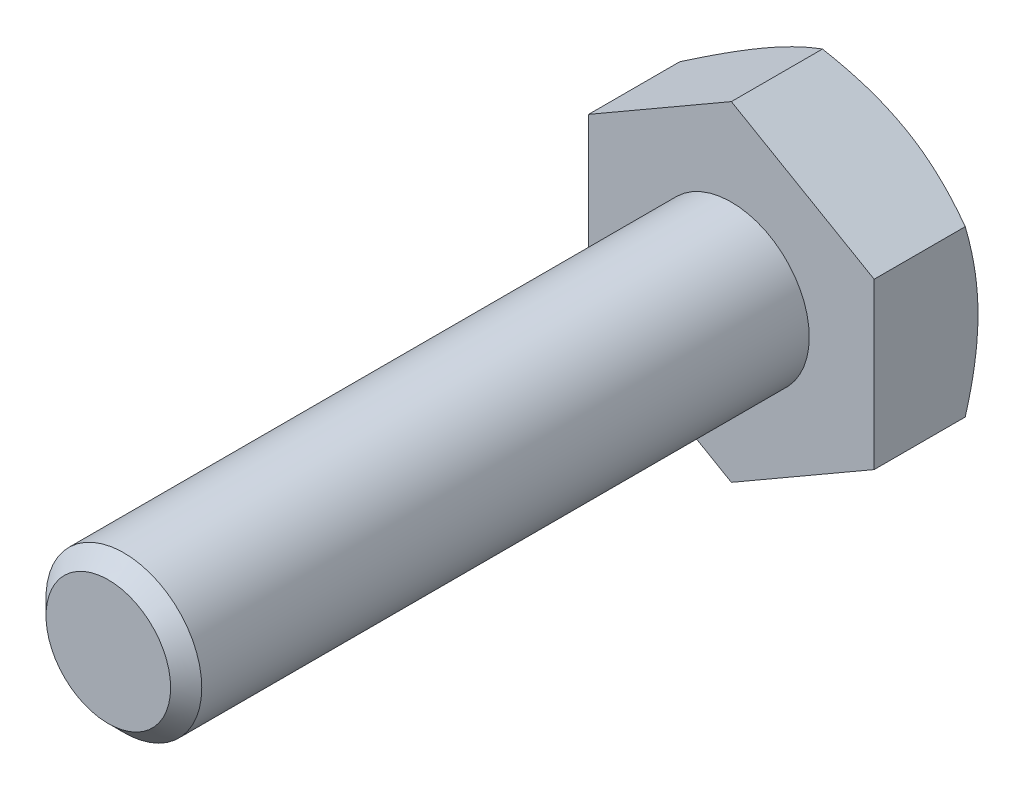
ISO-10303-21;
HEADER;
FILE_DESCRIPTION(('STEP AP214'),'2;1');
FILE_NAME('part.step','',(''),(''),'','','');
FILE_SCHEMA(('AUTOMOTIVE_DESIGN { 1 0 10303 214 1 1 1 1 }'));
ENDSEC;
DATA;
#1=APPLICATION_CONTEXT('core data for automotive mechanical design processes');
#2=APPLICATION_PROTOCOL_DEFINITION('international standard','automotive_design',2000,#1);
#3=PRODUCT_CONTEXT('',#1,'mechanical');
#4=PRODUCT('Part','Part','',(#3));
#5=PRODUCT_RELATED_PRODUCT_CATEGORY('part','',(#4));
#6=PRODUCT_DEFINITION_FORMATION('','',#4);
#7=PRODUCT_DEFINITION_CONTEXT('part definition',#1,'design');
#8=PRODUCT_DEFINITION('design','',#6,#7);
#9=PRODUCT_DEFINITION_SHAPE('','',#8);
#10=(LENGTH_UNIT() NAMED_UNIT(*) SI_UNIT(.MILLI.,.METRE.));
#11=(NAMED_UNIT(*) PLANE_ANGLE_UNIT() SI_UNIT($,.RADIAN.));
#12=(NAMED_UNIT(*) SI_UNIT($,.STERADIAN.) SOLID_ANGLE_UNIT());
#13=UNCERTAINTY_MEASURE_WITH_UNIT(LENGTH_MEASURE(1.E-05),#10,'distance_accuracy_value','');
#14=(GEOMETRIC_REPRESENTATION_CONTEXT(3) GLOBAL_UNCERTAINTY_ASSIGNED_CONTEXT((#13)) GLOBAL_UNIT_ASSIGNED_CONTEXT((#10,
#11,#12)) REPRESENTATION_CONTEXT('',''));
#15=CARTESIAN_POINT('',(0.,0.,0.));
#16=DIRECTION('',(0.,0.,1.));
#17=DIRECTION('',(1.,0.,0.));
#18=AXIS2_PLACEMENT_3D('',#15,#16,#17);
#19=CARTESIAN_POINT('',(0.,0.,12.));
#20=DIRECTION('',(0.,0.,1.));
#21=DIRECTION('',(1.,0.,0.));
#22=AXIS2_PLACEMENT_3D('',#19,#20,#21);
#23=PLANE('',#22);
#24=CARTESIAN_POINT('',(0.,0.,12.));
#25=DIRECTION('',(0.,0.,1.));
#26=DIRECTION('',(1.,0.,0.));
#27=AXIS2_PLACEMENT_3D('',#24,#25,#26);
#28=CIRCLE('',#27,1.2);
#29=CARTESIAN_POINT('',(1.2,0.,12.));
#30=VERTEX_POINT('',#29);
#31=EDGE_CURVE('E206',#30,#30,#28,.T.);
#32=ORIENTED_EDGE('',*,*,#31,.T.);
#33=EDGE_LOOP('',(#32));
#34=FACE_BOUND('',#33,.T.);
#35=ADVANCED_FACE('F32',(#34),#23,.T.);
#36=CARTESIAN_POINT('',(0.,0.,0.));
#37=DIRECTION('',(0.,0.,1.));
#38=DIRECTION('',(1.,0.,0.));
#39=AXIS2_PLACEMENT_3D('',#36,#37,#38);
#40=CYLINDRICAL_SURFACE('',#39,1.5);
#41=CARTESIAN_POINT('',(0.,0.,11.7));
#42=DIRECTION('',(0.,0.,1.));
#43=DIRECTION('',(1.,0.,0.));
#44=AXIS2_PLACEMENT_3D('',#41,#42,#43);
#45=CIRCLE('',#44,1.5);
#46=CARTESIAN_POINT('',(1.5,0.,11.7));
#47=VERTEX_POINT('',#46);
#48=EDGE_CURVE('E208',#47,#47,#45,.F.);
#49=ORIENTED_EDGE('',*,*,#48,.T.);
#50=EDGE_LOOP('',(#49));
#51=FACE_BOUND('',#50,.T.);
#52=CARTESIAN_POINT('',(0.,0.,0.));
#53=DIRECTION('',(0.,0.,1.));
#54=DIRECTION('',(1.,0.,0.));
#55=AXIS2_PLACEMENT_3D('',#52,#53,#54);
#56=CIRCLE('',#55,1.5);
#57=CARTESIAN_POINT('',(1.5,0.,0.));
#58=VERTEX_POINT('',#57);
#59=EDGE_CURVE('E209',#58,#58,#56,.F.);
#60=ORIENTED_EDGE('',*,*,#59,.F.);
#61=EDGE_LOOP('',(#60));
#62=FACE_BOUND('',#61,.T.);
#63=ADVANCED_FACE('F197',(#51,#62),#40,.T.);
#64=CARTESIAN_POINT('',(0.,0.,12.));
#65=DIRECTION('',(0.,0.,-1.));
#66=DIRECTION('',(-1.,0.,0.));
#67=AXIS2_PLACEMENT_3D('',#64,#65,#66);
#68=CONICAL_SURFACE('',#67,1.2,0.785398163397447);
#69=ORIENTED_EDGE('',*,*,#48,.F.);
#70=EDGE_LOOP('',(#69));
#71=FACE_BOUND('',#70,.T.);
#72=ORIENTED_EDGE('',*,*,#31,.F.);
#73=EDGE_LOOP('',(#72));
#74=FACE_BOUND('',#73,.T.);
#75=ADVANCED_FACE('F202',(#71,#74),#68,.T.);
#76=CARTESIAN_POINT('',(0.,3.17542648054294,-2.));
#77=DIRECTION('',(0.499999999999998,0.86602540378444,0.));
#78=DIRECTION('',(-0.86602540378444,0.499999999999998,0.));
#79=AXIS2_PLACEMENT_3D('',#76,#77,#78);
#80=PLANE('',#79);
#81=CARTESIAN_POINT('',(-0.000200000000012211,3.17554195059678,-1.75431323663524));
#82=CARTESIAN_POINT('',(0.120649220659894,3.10576962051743,-1.79461233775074));
#83=CARTESIAN_POINT('',(0.242541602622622,3.03539502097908,-1.83126309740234));
#84=CARTESIAN_POINT('',(0.488437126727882,2.89342717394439,-1.8952378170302));
#85=CARTESIAN_POINT('',(0.612444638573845,2.82183140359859,-1.9225391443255));
#86=CARTESIAN_POINT('',(0.858922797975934,2.67952717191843,-1.96503825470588));
#87=CARTESIAN_POINT('',(0.981355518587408,2.60884060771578,-1.98051888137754));
#88=CARTESIAN_POINT('',(1.22679714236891,2.46713482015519,-1.99900060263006));
#89=CARTESIAN_POINT('',(1.3498051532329,2.39611611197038,-2.0020170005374));
#90=CARTESIAN_POINT('',(1.57965878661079,2.26341005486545,-1.99574685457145));
#91=CARTESIAN_POINT('',(1.68653879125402,2.20170285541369,-1.9879998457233));
#92=CARTESIAN_POINT('',(1.89960246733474,2.07869048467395,-1.96344481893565));
#93=CARTESIAN_POINT('',(2.00578540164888,2.01738573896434,-1.94662841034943));
#94=CARTESIAN_POINT('',(2.21928848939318,1.89411967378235,-1.90458807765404));
#95=CARTESIAN_POINT('',(2.32658161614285,1.83217395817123,-1.87918591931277));
#96=CARTESIAN_POINT('',(2.53956747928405,1.70920651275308,-1.82153277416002));
#97=CARTESIAN_POINT('',(2.64526294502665,1.64818320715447,-1.78929533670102));
#98=CARTESIAN_POINT('',(2.7502,1.58759777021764,-1.75431323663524));
#99=B_SPLINE_CURVE_WITH_KNOTS('',3,(#81,#82,#83,#84,#85,#86,#87,#88,#89,#90,#91,#92,#93,#94,#95,
#96,#97,#98),.UNSPECIFIED.,.F.,.F.,(4,2,2,2,2,2,2,2,4),(0.,0.435912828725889,0.872873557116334,
1.29901931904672,1.72464171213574,2.09526089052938,2.46622354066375,2.84541551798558,
3.22386274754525),.UNSPECIFIED.);
#100=CARTESIAN_POINT('',(0.,3.17542648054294,-1.75437990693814));
#101=VERTEX_POINT('',#100);
#102=CARTESIAN_POINT('',(1.37499999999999,2.38156986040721,-2.));
#103=VERTEX_POINT('',#102);
#104=EDGE_CURVE('E242',#101,#103,#99,.T.);
#105=ORIENTED_EDGE('',*,*,#104,.F.);
#106=DIRECTION('',(0.,0.,1.));
#107=VECTOR('',#106,1.);
#108=CARTESIAN_POINT('',(0.,3.17542648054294,-2.));
#109=LINE('',#108,#107);
#110=CARTESIAN_POINT('',(0.,3.17542648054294,0.));
#111=VERTEX_POINT('',#110);
#112=EDGE_CURVE('E216',#101,#111,#109,.T.);
#113=ORIENTED_EDGE('',*,*,#112,.T.);
#114=DIRECTION('',(-0.86602540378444,0.499999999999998,0.));
#115=VECTOR('',#114,1.);
#116=CARTESIAN_POINT('',(0.,3.17542648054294,0.));
#117=LINE('',#116,#115);
#118=CARTESIAN_POINT('',(2.75,1.58771324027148,0.));
#119=VERTEX_POINT('',#118);
#120=EDGE_CURVE('E240',#119,#111,#117,.T.);
#121=ORIENTED_EDGE('',*,*,#120,.F.);
#122=DIRECTION('',(0.,0.,1.));
#123=VECTOR('',#122,1.);
#124=CARTESIAN_POINT('',(2.75,1.58771324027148,-2.));
#125=LINE('',#124,#123);
#126=CARTESIAN_POINT('',(2.75,1.58771324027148,-1.75437990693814));
#127=VERTEX_POINT('',#126);
#128=EDGE_CURVE('E213',#127,#119,#125,.T.);
#129=ORIENTED_EDGE('',*,*,#128,.F.);
#130=EDGE_CURVE('E172',#103,#127,#99,.T.);
#131=ORIENTED_EDGE('',*,*,#130,.F.);
#132=EDGE_LOOP('',(#105,#113,#121,#129,#131));
#133=FACE_BOUND('',#132,.T.);
#134=ADVANCED_FACE('F182',(#133),#80,.T.);
#135=CARTESIAN_POINT('',(2.75,-1.58771324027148,-2.));
#136=DIRECTION('',(1.,0.,0.));
#137=DIRECTION('',(0.,0.,-1.));
#138=AXIS2_PLACEMENT_3D('',#135,#136,#137);
#139=PLANE('',#138);
#140=CARTESIAN_POINT('',(2.75,-4.31638594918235,-0.632847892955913));
#141=CARTESIAN_POINT('',(2.75,-4.19581737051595,-0.691540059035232));
#142=CARTESIAN_POINT('',(2.75,-4.07497746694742,-0.749684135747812));
#143=CARTESIAN_POINT('',(2.75,-3.83261088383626,-0.864568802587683));
#144=CARTESIAN_POINT('',(2.75,-3.71108410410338,-0.921309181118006));
#145=CARTESIAN_POINT('',(2.75,-3.466598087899,-1.03335357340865));
#146=CARTESIAN_POINT('',(2.75,-3.34363468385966,-1.08864852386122));
#147=CARTESIAN_POINT('',(2.75,-3.09674757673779,-1.19704300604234));
#148=CARTESIAN_POINT('',(2.75,-2.97282391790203,-1.25014263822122));
#149=CARTESIAN_POINT('',(2.75,-2.71965806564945,-1.35529688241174));
#150=CARTESIAN_POINT('',(2.75,-2.59037652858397,-1.40725727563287));
#151=CARTESIAN_POINT('',(2.75,-2.3303201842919,-1.50736896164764));
#152=CARTESIAN_POINT('',(2.75,-2.19954521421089,-1.55551983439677));
#153=CARTESIAN_POINT('',(2.75,-1.93652234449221,-1.64678634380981));
#154=CARTESIAN_POINT('',(2.75,-1.80427786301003,-1.68991173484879));
#155=CARTESIAN_POINT('',(2.75,-1.53789259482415,-1.76977779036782));
#156=CARTESIAN_POINT('',(2.75,-1.40375240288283,-1.80652041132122));
#157=CARTESIAN_POINT('',(2.75,-1.13423793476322,-1.87169793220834));
#158=CARTESIAN_POINT('',(2.75,-0.998874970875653,-1.90017876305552));
#159=CARTESIAN_POINT('',(2.75,-0.726413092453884,-1.94725438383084));
#160=CARTESIAN_POINT('',(2.75,-0.589314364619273,-1.96585022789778));
#161=CARTESIAN_POINT('',(2.75,-0.315877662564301,-1.99143141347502));
#162=CARTESIAN_POINT('',(2.75,-0.179554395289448,-1.99857007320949));
#163=CARTESIAN_POINT('',(2.75,0.0932131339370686,-2.00103867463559));
#164=CARTESIAN_POINT('',(2.75,0.22965739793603,-1.99636841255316));
#165=CARTESIAN_POINT('',(2.75,0.459764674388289,-1.97886953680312));
#166=CARTESIAN_POINT('',(2.75,0.5536672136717,-1.96899498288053));
#167=CARTESIAN_POINT('',(2.75,0.740814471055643,-1.94423986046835));
#168=CARTESIAN_POINT('',(2.75,0.834059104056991,-1.92935865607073));
#169=CARTESIAN_POINT('',(2.75,1.11266283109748,-1.87798420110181));
#170=CARTESIAN_POINT('',(2.75,1.29679769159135,-1.83476823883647));
#171=CARTESIAN_POINT('',(2.75,1.57226006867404,-1.75944008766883));
#172=CARTESIAN_POINT('',(2.75,1.66500394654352,-1.73220910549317));
#173=CARTESIAN_POINT('',(2.75,1.84959145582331,-1.67482333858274));
#174=CARTESIAN_POINT('',(2.75,1.94143508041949,-1.64466853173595));
#175=CARTESIAN_POINT('',(2.75,2.12425036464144,-1.58192697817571));
#176=CARTESIAN_POINT('',(2.75,2.21522226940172,-1.54934093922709));
#177=CARTESIAN_POINT('',(2.75,2.39640501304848,-1.48212985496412));
#178=CARTESIAN_POINT('',(2.75,2.4866158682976,-1.44750485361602));
#179=CARTESIAN_POINT('',(2.75,2.72631941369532,-1.35288813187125));
#180=CARTESIAN_POINT('',(2.75,2.87521406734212,-1.29138286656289));
#181=CARTESIAN_POINT('',(2.75,3.17149877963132,-1.16483689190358));
#182=CARTESIAN_POINT('',(2.75,3.31888867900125,-1.09979581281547));
#183=CARTESIAN_POINT('',(2.75,3.61249860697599,-0.967006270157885));
#184=CARTESIAN_POINT('',(2.75,3.75871823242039,-0.899256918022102));
#185=CARTESIAN_POINT('',(2.75,4.05017738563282,-0.761678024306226));
#186=CARTESIAN_POINT('',(2.75,4.1954168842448,-0.691848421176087));
#187=CARTESIAN_POINT('',(2.75,4.63039070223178,-0.479727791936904));
#188=CARTESIAN_POINT('',(2.75,4.91893915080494,-0.33500805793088));
#189=CARTESIAN_POINT('',(2.75,5.49386340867,-0.0414857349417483));
#190=CARTESIAN_POINT('',(2.75,5.78023963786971,0.107316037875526));
#191=CARTESIAN_POINT('',(2.75,6.32194576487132,0.392167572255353));
#192=CARTESIAN_POINT('',(2.75,6.57742037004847,0.527942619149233));
#193=CARTESIAN_POINT('',(2.75,7.08750371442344,0.801142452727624));
#194=CARTESIAN_POINT('',(2.75,7.34211240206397,0.938567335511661));
#195=CARTESIAN_POINT('',(2.75,7.84983547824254,1.21419429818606));
#196=CARTESIAN_POINT('',(2.75,8.10295203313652,1.35239239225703));
#197=CARTESIAN_POINT('',(2.75,8.60864374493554,1.6297305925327));
#198=CARTESIAN_POINT('',(2.75,8.86121894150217,1.76887062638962));
#199=CARTESIAN_POINT('',(2.75,9.11360311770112,1.90835389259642));
#200=B_SPLINE_CURVE_WITH_KNOTS('',3,(#140,#141,#142,#143,#144,#145,#146,#147,#148,#149,#150,
#151,#152,#153,#154,#155,#156,#157,#158,#159,#160,#161,#162,#163,#164,#165,#166,#167,#168,#169,
#170,#171,#172,#173,#174,#175,#176,#177,#178,#179,#180,#181,#182,#183,#184,#185,#186,#187,#188,
#189,#190,#191,#192,#193,#194,#195,#196,#197,#198,#199),.UNSPECIFIED.,.F.,.F.,(4,2,2,2,2,2,2,2,
2,2,2,2,2,2,2,2,2,2,2,2,2,2,2,2,2,2,2,2,2,4),(0.,0.402290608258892,0.804641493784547,
1.20909649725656,1.6135329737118,2.03148461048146,2.44948226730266,2.86665458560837,
3.28369880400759,3.69837799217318,4.11301294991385,4.52205162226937,4.93109735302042,
5.21422195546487,5.49738253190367,6.06398562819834,6.35393648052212,6.64388952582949,
6.93375848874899,7.22362120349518,7.70684704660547,8.19012351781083,8.67355987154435,
9.15701054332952,10.1253686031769,11.0935344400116,11.9614658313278,12.8294480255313,
13.694604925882,14.5596961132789),.UNSPECIFIED.);
#201=CARTESIAN_POINT('',(2.75,0.,-2.));
#202=VERTEX_POINT('',#201);
#203=EDGE_CURVE('E170',#127,#202,#200,.F.);
#204=ORIENTED_EDGE('',*,*,#203,.F.);
#205=ORIENTED_EDGE('',*,*,#128,.T.);
#206=DIRECTION('',(0.,1.,0.));
#207=VECTOR('',#206,1.);
#208=CARTESIAN_POINT('',(2.75,-1.58771324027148,0.));
#209=LINE('',#208,#207);
#210=CARTESIAN_POINT('',(2.75,-1.58771324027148,0.));
#211=VERTEX_POINT('',#210);
#212=EDGE_CURVE('E218',#211,#119,#209,.T.);
#213=ORIENTED_EDGE('',*,*,#212,.F.);
#214=DIRECTION('',(0.,0.,1.));
#215=VECTOR('',#214,1.);
#216=CARTESIAN_POINT('',(2.75,-1.58771324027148,-2.));
#217=LINE('',#216,#215);
#218=CARTESIAN_POINT('',(2.75,-1.58771324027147,-1.75437990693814));
#219=VERTEX_POINT('',#218);
#220=EDGE_CURVE('E224',#219,#211,#217,.T.);
#221=ORIENTED_EDGE('',*,*,#220,.F.);
#222=EDGE_CURVE('E165',#202,#219,#200,.F.);
#223=ORIENTED_EDGE('',*,*,#222,.F.);
#224=EDGE_LOOP('',(#204,#205,#213,#221,#223));
#225=FACE_BOUND('',#224,.T.);
#226=ADVANCED_FACE('F178',(#225),#139,.T.);
#227=CARTESIAN_POINT('',(0.,-3.17542648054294,-2.));
#228=DIRECTION('',(0.499999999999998,-0.86602540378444,0.));
#229=DIRECTION('',(0.86602540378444,0.499999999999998,0.));
#230=AXIS2_PLACEMENT_3D('',#227,#228,#229);
#231=PLANE('',#230);
#232=CARTESIAN_POINT('',(2.7502,-1.58759777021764,-1.75431323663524));
#233=CARTESIAN_POINT('',(2.62935077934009,-1.65737010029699,-1.79461233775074));
#234=CARTESIAN_POINT('',(2.50745839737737,-1.72774469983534,-1.83126309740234));
#235=CARTESIAN_POINT('',(2.26156287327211,-1.86971254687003,-1.8952378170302));
#236=CARTESIAN_POINT('',(2.13755536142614,-1.94130831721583,-1.9225391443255));
#237=CARTESIAN_POINT('',(1.89107720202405,-2.08361254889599,-1.96503825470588));
#238=CARTESIAN_POINT('',(1.76864448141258,-2.15429911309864,-1.98051888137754));
#239=CARTESIAN_POINT('',(1.52320285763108,-2.29600490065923,-1.99900060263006));
#240=CARTESIAN_POINT('',(1.40019484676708,-2.36702360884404,-2.0020170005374));
#241=CARTESIAN_POINT('',(1.1703412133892,-2.49972966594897,-1.99574685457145));
#242=CARTESIAN_POINT('',(1.06346120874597,-2.56143686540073,-1.9879998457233));
#243=CARTESIAN_POINT('',(0.850397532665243,-2.68444923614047,-1.96344481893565));
#244=CARTESIAN_POINT('',(0.744214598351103,-2.74575398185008,-1.94662841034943));
#245=CARTESIAN_POINT('',(0.530711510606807,-2.86902004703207,-1.90458807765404));
#246=CARTESIAN_POINT('',(0.423418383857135,-2.93096576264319,-1.87918591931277));
#247=CARTESIAN_POINT('',(0.210432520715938,-3.05393320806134,-1.82153277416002));
#248=CARTESIAN_POINT('',(0.104737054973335,-3.11495651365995,-1.78929533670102));
#249=CARTESIAN_POINT('',(-0.000200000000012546,-3.17554195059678,-1.75431323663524));
#250=B_SPLINE_CURVE_WITH_KNOTS('',3,(#232,#233,#234,#235,#236,#237,#238,#239,#240,#241,#242,
#243,#244,#245,#246,#247,#248,#249),.UNSPECIFIED.,.F.,.F.,(4,2,2,2,2,2,2,2,4),(0.,
0.435912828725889,0.872873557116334,1.29901931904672,1.72464171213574,2.09526089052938,
2.46622354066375,2.84541551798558,3.22386274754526),.UNSPECIFIED.);
#251=CARTESIAN_POINT('',(1.37499999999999,-2.38156986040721,-2.));
#252=VERTEX_POINT('',#251);
#253=EDGE_CURVE('E171',#219,#252,#250,.T.);
#254=ORIENTED_EDGE('',*,*,#253,.F.);
#255=ORIENTED_EDGE('',*,*,#220,.T.);
#256=DIRECTION('',(0.86602540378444,0.499999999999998,0.));
#257=VECTOR('',#256,1.);
#258=CARTESIAN_POINT('',(0.,-3.17542648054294,0.));
#259=LINE('',#258,#257);
#260=CARTESIAN_POINT('',(0.,-3.17542648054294,0.));
#261=VERTEX_POINT('',#260);
#262=EDGE_CURVE('E229',#261,#211,#259,.T.);
#263=ORIENTED_EDGE('',*,*,#262,.F.);
#264=DIRECTION('',(0.,0.,1.));
#265=VECTOR('',#264,1.);
#266=CARTESIAN_POINT('',(0.,-3.17542648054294,-2.));
#267=LINE('',#266,#265);
#268=CARTESIAN_POINT('',(0.,-3.17542648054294,-1.75437990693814));
#269=VERTEX_POINT('',#268);
#270=EDGE_CURVE('E222',#269,#261,#267,.T.);
#271=ORIENTED_EDGE('',*,*,#270,.F.);
#272=EDGE_CURVE('E159',#252,#269,#250,.T.);
#273=ORIENTED_EDGE('',*,*,#272,.F.);
#274=EDGE_LOOP('',(#254,#255,#263,#271,#273));
#275=FACE_BOUND('',#274,.T.);
#276=ADVANCED_FACE('F181',(#275),#231,.T.);
#277=CARTESIAN_POINT('',(0.,-3.17542648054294,-2.));
#278=DIRECTION('',(-0.500000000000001,-0.866025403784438,0.));
#279=DIRECTION('',(0.866025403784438,-0.500000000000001,0.));
#280=AXIS2_PLACEMENT_3D('',#277,#278,#279);
#281=PLANE('',#280);
#282=CARTESIAN_POINT('',(0.000199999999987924,-3.17554195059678,-1.75431323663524));
#283=CARTESIAN_POINT('',(-0.120649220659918,-3.10576962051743,-1.79461233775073));
#284=CARTESIAN_POINT('',(-0.242541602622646,-3.03539502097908,-1.83126309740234));
#285=CARTESIAN_POINT('',(-0.488437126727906,-2.89342717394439,-1.8952378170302));
#286=CARTESIAN_POINT('',(-0.612444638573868,-2.82183140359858,-1.9225391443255));
#287=CARTESIAN_POINT('',(-0.858922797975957,-2.67952717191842,-1.96503825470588));
#288=CARTESIAN_POINT('',(-0.981355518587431,-2.60884060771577,-1.98051888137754));
#289=CARTESIAN_POINT('',(-1.22679714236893,-2.46713482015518,-1.99900060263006));
#290=CARTESIAN_POINT('',(-1.34980515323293,-2.39611611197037,-2.0020170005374));
#291=CARTESIAN_POINT('',(-1.57965878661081,-2.26341005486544,-1.99574685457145));
#292=CARTESIAN_POINT('',(-1.68653879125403,-2.20170285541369,-1.98799984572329));
#293=CARTESIAN_POINT('',(-1.89960246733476,-2.07869048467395,-1.96344481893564));
#294=CARTESIAN_POINT('',(-2.0057854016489,-2.01738573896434,-1.94662841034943));
#295=CARTESIAN_POINT('',(-2.21928848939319,-1.89411967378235,-1.90458807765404));
#296=CARTESIAN_POINT('',(-2.32658161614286,-1.83217395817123,-1.87918591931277));
#297=CARTESIAN_POINT('',(-2.53956747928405,-1.70920651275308,-1.82153277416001));
#298=CARTESIAN_POINT('',(-2.64526294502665,-1.64818320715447,-1.78929533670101));
#299=CARTESIAN_POINT('',(-2.7502,-1.58759777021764,-1.75431323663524));
#300=B_SPLINE_CURVE_WITH_KNOTS('',3,(#282,#283,#284,#285,#286,#287,#288,#289,#290,#291,#292,
#293,#294,#295,#296,#297,#298,#299),.UNSPECIFIED.,.F.,.F.,(4,2,2,2,2,2,2,2,4),(0.,
0.435912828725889,0.872873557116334,1.29901931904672,1.72464171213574,2.09526089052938,
2.46622354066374,2.84541551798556,3.22386274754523),.UNSPECIFIED.);
#301=CARTESIAN_POINT('',(-1.375,-2.38156986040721,-2.));
#302=VERTEX_POINT('',#301);
#303=EDGE_CURVE('E261',#269,#302,#300,.T.);
#304=ORIENTED_EDGE('',*,*,#303,.F.);
#305=ORIENTED_EDGE('',*,*,#270,.T.);
#306=DIRECTION('',(0.866025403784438,-0.500000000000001,0.));
#307=VECTOR('',#306,1.);
#308=CARTESIAN_POINT('',(0.,-3.17542648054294,0.));
#309=LINE('',#308,#307);
#310=CARTESIAN_POINT('',(-2.75,-1.58771324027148,0.));
#311=VERTEX_POINT('',#310);
#312=EDGE_CURVE('E232',#311,#261,#309,.T.);
#313=ORIENTED_EDGE('',*,*,#312,.F.);
#314=DIRECTION('',(0.,0.,1.));
#315=VECTOR('',#314,1.);
#316=CARTESIAN_POINT('',(-2.75,-1.58771324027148,-2.));
#317=LINE('',#316,#315);
#318=CARTESIAN_POINT('',(-2.75,-1.58771324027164,-1.75437990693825));
#319=VERTEX_POINT('',#318);
#320=EDGE_CURVE('E220',#319,#311,#317,.T.);
#321=ORIENTED_EDGE('',*,*,#320,.F.);
#322=EDGE_CURVE('E108',#302,#319,#300,.T.);
#323=ORIENTED_EDGE('',*,*,#322,.F.);
#324=EDGE_LOOP('',(#304,#305,#313,#321,#323));
#325=FACE_BOUND('',#324,.T.);
#326=ADVANCED_FACE('F186',(#325),#281,.T.);
#327=CARTESIAN_POINT('',(-2.75,-1.58771324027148,-2.));
#328=DIRECTION('',(-1.,0.,0.));
#329=DIRECTION('',(0.,0.,1.));
#330=AXIS2_PLACEMENT_3D('',#327,#328,#329);
#331=PLANE('',#330);
#332=CARTESIAN_POINT('',(-2.75,-4.31638594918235,-0.632847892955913));
#333=CARTESIAN_POINT('',(-2.75,-4.19581737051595,-0.691540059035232));
#334=CARTESIAN_POINT('',(-2.75,-4.07497746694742,-0.749684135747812));
#335=CARTESIAN_POINT('',(-2.75,-3.83261088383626,-0.864568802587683));
#336=CARTESIAN_POINT('',(-2.75,-3.71108410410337,-0.921309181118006));
#337=CARTESIAN_POINT('',(-2.75,-3.466598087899,-1.03335357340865));
#338=CARTESIAN_POINT('',(-2.75,-3.34363468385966,-1.08864852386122));
#339=CARTESIAN_POINT('',(-2.75,-3.09674757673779,-1.19704300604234));
#340=CARTESIAN_POINT('',(-2.75,-2.97282391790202,-1.25014263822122));
#341=CARTESIAN_POINT('',(-2.75,-2.71965806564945,-1.35529688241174));
#342=CARTESIAN_POINT('',(-2.75,-2.59037652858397,-1.40725727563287));
#343=CARTESIAN_POINT('',(-2.75,-2.3303201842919,-1.50736896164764));
#344=CARTESIAN_POINT('',(-2.75,-2.19954521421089,-1.55551983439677));
#345=CARTESIAN_POINT('',(-2.75,-1.93652234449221,-1.64678634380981));
#346=CARTESIAN_POINT('',(-2.75,-1.80427786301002,-1.68991173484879));
#347=CARTESIAN_POINT('',(-2.75,-1.53789259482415,-1.76977779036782));
#348=CARTESIAN_POINT('',(-2.75,-1.40375240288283,-1.80652041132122));
#349=CARTESIAN_POINT('',(-2.75,-1.13423793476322,-1.87169793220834));
#350=CARTESIAN_POINT('',(-2.75,-0.998874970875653,-1.90017876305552));
#351=CARTESIAN_POINT('',(-2.75,-0.726413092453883,-1.94725438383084));
#352=CARTESIAN_POINT('',(-2.75,-0.589314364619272,-1.96585022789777));
#353=CARTESIAN_POINT('',(-2.75,-0.315877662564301,-1.99143141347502));
#354=CARTESIAN_POINT('',(-2.75,-0.179554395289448,-1.99857007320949));
#355=CARTESIAN_POINT('',(-2.75,0.093213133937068,-2.00103867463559));
#356=CARTESIAN_POINT('',(-2.75,0.229657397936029,-1.99636841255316));
#357=CARTESIAN_POINT('',(-2.75,0.459764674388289,-1.97886953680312));
#358=CARTESIAN_POINT('',(-2.75,0.5536672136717,-1.96899498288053));
#359=CARTESIAN_POINT('',(-2.75,0.740814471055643,-1.94423986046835));
#360=CARTESIAN_POINT('',(-2.75,0.834059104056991,-1.92935865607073));
#361=CARTESIAN_POINT('',(-2.75,1.11266283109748,-1.87798420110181));
#362=CARTESIAN_POINT('',(-2.75,1.29679769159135,-1.83476823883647));
#363=CARTESIAN_POINT('',(-2.75,1.57226006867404,-1.75944008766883));
#364=CARTESIAN_POINT('',(-2.75,1.66500394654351,-1.73220910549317));
#365=CARTESIAN_POINT('',(-2.75,1.84959145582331,-1.67482333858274));
#366=CARTESIAN_POINT('',(-2.75,1.94143508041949,-1.64466853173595));
#367=CARTESIAN_POINT('',(-2.75,2.12425036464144,-1.58192697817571));
#368=CARTESIAN_POINT('',(-2.75,2.21522226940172,-1.54934093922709));
#369=CARTESIAN_POINT('',(-2.75,2.39640501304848,-1.48212985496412));
#370=CARTESIAN_POINT('',(-2.75,2.4866158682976,-1.44750485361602));
#371=CARTESIAN_POINT('',(-2.75,2.72631941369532,-1.35288813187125));
#372=CARTESIAN_POINT('',(-2.75,2.87521406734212,-1.29138286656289));
#373=CARTESIAN_POINT('',(-2.75,3.17149877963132,-1.16483689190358));
#374=CARTESIAN_POINT('',(-2.75,3.31888867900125,-1.09979581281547));
#375=CARTESIAN_POINT('',(-2.75,3.61249860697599,-0.967006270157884));
#376=CARTESIAN_POINT('',(-2.75,3.75871823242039,-0.8992569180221));
#377=CARTESIAN_POINT('',(-2.75,4.05017738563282,-0.761678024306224));
#378=CARTESIAN_POINT('',(-2.75,4.1954168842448,-0.691848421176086));
#379=CARTESIAN_POINT('',(-2.75,4.63039070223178,-0.479727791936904));
#380=CARTESIAN_POINT('',(-2.75,4.91893915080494,-0.335008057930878));
#381=CARTESIAN_POINT('',(-2.75,5.49386340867,-0.0414857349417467));
#382=CARTESIAN_POINT('',(-2.75,5.78023963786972,0.107316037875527));
#383=CARTESIAN_POINT('',(-2.75,6.32194576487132,0.392167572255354));
#384=CARTESIAN_POINT('',(-2.75,6.57742037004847,0.527942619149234));
#385=CARTESIAN_POINT('',(-2.75,7.08750371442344,0.801142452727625));
#386=CARTESIAN_POINT('',(-2.75,7.34211240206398,0.938567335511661));
#387=CARTESIAN_POINT('',(-2.75,7.84983547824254,1.21419429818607));
#388=CARTESIAN_POINT('',(-2.75,8.10295203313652,1.35239239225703));
#389=CARTESIAN_POINT('',(-2.75,8.60864374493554,1.6297305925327));
#390=CARTESIAN_POINT('',(-2.75,8.86121894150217,1.76887062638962));
#391=CARTESIAN_POINT('',(-2.75,9.11360311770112,1.90835389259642));
#392=B_SPLINE_CURVE_WITH_KNOTS('',3,(#332,#333,#334,#335,#336,#337,#338,#339,#340,#341,#342,
#343,#344,#345,#346,#347,#348,#349,#350,#351,#352,#353,#354,#355,#356,#357,#358,#359,#360,#361,
#362,#363,#364,#365,#366,#367,#368,#369,#370,#371,#372,#373,#374,#375,#376,#377,#378,#379,#380,
#381,#382,#383,#384,#385,#386,#387,#388,#389,#390,#391),.UNSPECIFIED.,.F.,.F.,(4,2,2,2,2,2,2,2,
2,2,2,2,2,2,2,2,2,2,2,2,2,2,2,2,2,2,2,2,2,4),(0.,0.402290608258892,0.804641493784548,
1.20909649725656,1.6135329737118,2.03148461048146,2.44948226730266,2.86665458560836,
3.28369880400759,3.69837799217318,4.11301294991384,4.52205162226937,4.93109735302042,
5.21422195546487,5.49738253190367,6.06398562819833,6.35393648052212,6.64388952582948,
6.93375848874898,7.22362120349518,7.70684704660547,8.19012351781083,8.67355987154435,
9.15701054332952,10.1253686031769,11.0935344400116,11.9614658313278,12.8294480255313,
13.694604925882,14.5596961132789),.UNSPECIFIED.);
#393=CARTESIAN_POINT('',(-2.75,0.,-2.));
#394=VERTEX_POINT('',#393);
#395=EDGE_CURVE('E103',#319,#394,#392,.T.);
#396=ORIENTED_EDGE('',*,*,#395,.F.);
#397=ORIENTED_EDGE('',*,*,#320,.T.);
#398=DIRECTION('',(0.,-1.,0.));
#399=VECTOR('',#398,1.);
#400=CARTESIAN_POINT('',(-2.75,-1.58771324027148,0.));
#401=LINE('',#400,#399);
#402=CARTESIAN_POINT('',(-2.75,1.58771324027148,0.));
#403=VERTEX_POINT('',#402);
#404=EDGE_CURVE('E235',#403,#311,#401,.T.);
#405=ORIENTED_EDGE('',*,*,#404,.F.);
#406=DIRECTION('',(0.,0.,1.));
#407=VECTOR('',#406,1.);
#408=CARTESIAN_POINT('',(-2.75,1.58771324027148,-2.));
#409=LINE('',#408,#407);
#410=CARTESIAN_POINT('',(-2.75,1.58771324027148,-1.75437990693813));
#411=VERTEX_POINT('',#410);
#412=EDGE_CURVE('E129',#411,#403,#409,.T.);
#413=ORIENTED_EDGE('',*,*,#412,.F.);
#414=EDGE_CURVE('E112',#394,#411,#392,.T.);
#415=ORIENTED_EDGE('',*,*,#414,.F.);
#416=EDGE_LOOP('',(#396,#397,#405,#413,#415));
#417=FACE_BOUND('',#416,.T.);
#418=ADVANCED_FACE('F127',(#417),#331,.T.);
#419=CARTESIAN_POINT('',(-2.75,1.58771324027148,-2.));
#420=DIRECTION('',(-0.500000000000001,0.866025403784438,0.));
#421=DIRECTION('',(-0.866025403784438,-0.500000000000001,0.));
#422=AXIS2_PLACEMENT_3D('',#419,#420,#421);
#423=PLANE('',#422);
#424=CARTESIAN_POINT('',(-2.7502,1.58759777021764,-1.75431323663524));
#425=CARTESIAN_POINT('',(-2.6293507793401,1.65737010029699,-1.79461233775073));
#426=CARTESIAN_POINT('',(-2.50745839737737,1.72774469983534,-1.83126309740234));
#427=CARTESIAN_POINT('',(-2.26156287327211,1.86971254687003,-1.8952378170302));
#428=CARTESIAN_POINT('',(-2.13755536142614,1.94130831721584,-1.9225391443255));
#429=CARTESIAN_POINT('',(-1.89107720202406,2.083612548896,-1.96503825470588));
#430=CARTESIAN_POINT('',(-1.76864448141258,2.15429911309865,-1.98051888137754));
#431=CARTESIAN_POINT('',(-1.52320285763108,2.29600490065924,-1.99900060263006));
#432=CARTESIAN_POINT('',(-1.40019484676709,2.36702360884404,-2.0020170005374));
#433=CARTESIAN_POINT('',(-1.17034121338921,2.49972966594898,-1.99574685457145));
#434=CARTESIAN_POINT('',(-1.06346120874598,2.56143686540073,-1.98799984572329));
#435=CARTESIAN_POINT('',(-0.850397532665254,2.68444923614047,-1.96344481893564));
#436=CARTESIAN_POINT('',(-0.744214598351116,2.74575398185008,-1.94662841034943));
#437=CARTESIAN_POINT('',(-0.530711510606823,2.86902004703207,-1.90458807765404));
#438=CARTESIAN_POINT('',(-0.423418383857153,2.93096576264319,-1.87918591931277));
#439=CARTESIAN_POINT('',(-0.210432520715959,3.05393320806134,-1.82153277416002));
#440=CARTESIAN_POINT('',(-0.104737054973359,3.11495651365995,-1.78929533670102));
#441=CARTESIAN_POINT('',(0.000199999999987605,3.17554195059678,-1.75431323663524));
#442=B_SPLINE_CURVE_WITH_KNOTS('',3,(#424,#425,#426,#427,#428,#429,#430,#431,#432,#433,#434,
#435,#436,#437,#438,#439,#440,#441),.UNSPECIFIED.,.F.,.F.,(4,2,2,2,2,2,2,2,4),(0.,
0.435912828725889,0.872873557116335,1.29901931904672,1.72464171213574,2.09526089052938,
2.46622354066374,2.84541551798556,3.22386274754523),.UNSPECIFIED.);
#443=CARTESIAN_POINT('',(-1.37500000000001,2.38156986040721,-2.));
#444=VERTEX_POINT('',#443);
#445=EDGE_CURVE('E118',#411,#444,#442,.T.);
#446=ORIENTED_EDGE('',*,*,#445,.F.);
#447=ORIENTED_EDGE('',*,*,#412,.T.);
#448=DIRECTION('',(-0.866025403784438,-0.500000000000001,0.));
#449=VECTOR('',#448,1.);
#450=CARTESIAN_POINT('',(-2.75,1.58771324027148,0.));
#451=LINE('',#450,#449);
#452=EDGE_CURVE('E238',#111,#403,#451,.T.);
#453=ORIENTED_EDGE('',*,*,#452,.F.);
#454=ORIENTED_EDGE('',*,*,#112,.F.);
#455=EDGE_CURVE('E120',#444,#101,#442,.T.);
#456=ORIENTED_EDGE('',*,*,#455,.F.);
#457=EDGE_LOOP('',(#446,#447,#453,#454,#456));
#458=FACE_BOUND('',#457,.T.);
#459=ADVANCED_FACE('F194',(#458),#423,.T.);
#460=CARTESIAN_POINT('',(2.75,1.58771324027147,0.));
#461=DIRECTION('',(0.,0.,1.));
#462=DIRECTION('',(1.,0.,0.));
#463=AXIS2_PLACEMENT_3D('',#460,#461,#462);
#464=PLANE('',#463);
#465=ORIENTED_EDGE('',*,*,#59,.T.);
#466=EDGE_LOOP('',(#465));
#467=FACE_BOUND('',#466,.T.);
#468=ORIENTED_EDGE('',*,*,#120,.T.);
#469=ORIENTED_EDGE('',*,*,#452,.T.);
#470=ORIENTED_EDGE('',*,*,#404,.T.);
#471=ORIENTED_EDGE('',*,*,#312,.T.);
#472=ORIENTED_EDGE('',*,*,#262,.T.);
#473=ORIENTED_EDGE('',*,*,#212,.T.);
#474=EDGE_LOOP('',(#468,#469,#470,#471,#472,#473));
#475=FACE_BOUND('',#474,.T.);
#476=ADVANCED_FACE('F151',(#467,#475),#464,.T.);
#477=CARTESIAN_POINT('',(0.,0.,0.));
#478=DIRECTION('',(0.,0.,1.));
#479=DIRECTION('',(1.,0.,0.));
#480=AXIS2_PLACEMENT_3D('',#477,#478,#479);
#481=CONICAL_SURFACE('',#480,6.21410161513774,1.0471975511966);
#482=ORIENTED_EDGE('',*,*,#130,.T.);
#483=ORIENTED_EDGE('',*,*,#203,.T.);
#484=CARTESIAN_POINT('',(0.,0.,-2.));
#485=DIRECTION('',(0.,0.,1.));
#486=DIRECTION('',(1.,0.,0.));
#487=AXIS2_PLACEMENT_3D('',#484,#485,#486);
#488=CIRCLE('',#487,2.75);
#489=EDGE_CURVE('E35',#103,#202,#488,.F.);
#490=ORIENTED_EDGE('',*,*,#489,.F.);
#491=EDGE_LOOP('',(#482,#483,#490));
#492=FACE_BOUND('',#491,.T.);
#493=ADVANCED_FACE('F251',(#492),#481,.T.);
#494=ORIENTED_EDGE('',*,*,#104,.T.);
#495=EDGE_CURVE('E125',#444,#103,#488,.F.);
#496=ORIENTED_EDGE('',*,*,#495,.F.);
#497=ORIENTED_EDGE('',*,*,#455,.T.);
#498=EDGE_LOOP('',(#494,#496,#497));
#499=FACE_BOUND('',#498,.T.);
#500=ADVANCED_FACE('F150',(#499),#481,.T.);
#501=ORIENTED_EDGE('',*,*,#414,.T.);
#502=ORIENTED_EDGE('',*,*,#445,.T.);
#503=CARTESIAN_POINT('',(0.,0.,-2.));
#504=DIRECTION('',(0.,0.,-1.));
#505=DIRECTION('',(-1.,0.,0.));
#506=AXIS2_PLACEMENT_3D('',#503,#504,#505);
#507=CIRCLE('',#506,2.75);
#508=EDGE_CURVE('E53',#394,#444,#507,.T.);
#509=ORIENTED_EDGE('',*,*,#508,.F.);
#510=EDGE_LOOP('',(#501,#502,#509));
#511=FACE_BOUND('',#510,.T.);
#512=ADVANCED_FACE('F116',(#511),#481,.T.);
#513=ORIENTED_EDGE('',*,*,#322,.T.);
#514=ORIENTED_EDGE('',*,*,#395,.T.);
#515=EDGE_CURVE('E105',#302,#394,#488,.F.);
#516=ORIENTED_EDGE('',*,*,#515,.F.);
#517=EDGE_LOOP('',(#513,#514,#516));
#518=FACE_BOUND('',#517,.T.);
#519=ADVANCED_FACE('F104',(#518),#481,.T.);
#520=ORIENTED_EDGE('',*,*,#272,.T.);
#521=ORIENTED_EDGE('',*,*,#303,.T.);
#522=EDGE_CURVE('E40',#252,#302,#488,.F.);
#523=ORIENTED_EDGE('',*,*,#522,.F.);
#524=EDGE_LOOP('',(#520,#521,#523));
#525=FACE_BOUND('',#524,.T.);
#526=ADVANCED_FACE('F263',(#525),#481,.T.);
#527=ORIENTED_EDGE('',*,*,#222,.T.);
#528=ORIENTED_EDGE('',*,*,#253,.T.);
#529=EDGE_CURVE('E11',#202,#252,#488,.F.);
#530=ORIENTED_EDGE('',*,*,#529,.F.);
#531=EDGE_LOOP('',(#527,#528,#530));
#532=FACE_BOUND('',#531,.T.);
#533=ADVANCED_FACE('F258',(#532),#481,.T.);
#534=CARTESIAN_POINT('',(2.75,1.58771324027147,-2.));
#535=DIRECTION('',(0.,0.,1.));
#536=DIRECTION('',(1.,0.,0.));
#537=AXIS2_PLACEMENT_3D('',#534,#535,#536);
#538=PLANE('',#537);
#539=ORIENTED_EDGE('',*,*,#489,.T.);
#540=ORIENTED_EDGE('',*,*,#529,.T.);
#541=ORIENTED_EDGE('',*,*,#522,.T.);
#542=ORIENTED_EDGE('',*,*,#515,.T.);
#543=ORIENTED_EDGE('',*,*,#508,.T.);
#544=ORIENTED_EDGE('',*,*,#495,.T.);
#545=EDGE_LOOP('',(#539,#540,#541,#542,#543,#544));
#546=FACE_BOUND('',#545,.T.);
#547=ADVANCED_FACE('F123',(#546),#538,.F.);
#548=CLOSED_SHELL('',(#35,#63,#75,#134,#226,#276,#326,#418,#459,#476,#493,#500,#512,#519,#526,
#533,#547));
#549=MANIFOLD_SOLID_BREP('B2',#548);
#550=ADVANCED_BREP_SHAPE_REPRESENTATION('',(#18,#549),#14);
#551=SHAPE_DEFINITION_REPRESENTATION(#9,#550);
ENDSEC;
END-ISO-10303-21;
